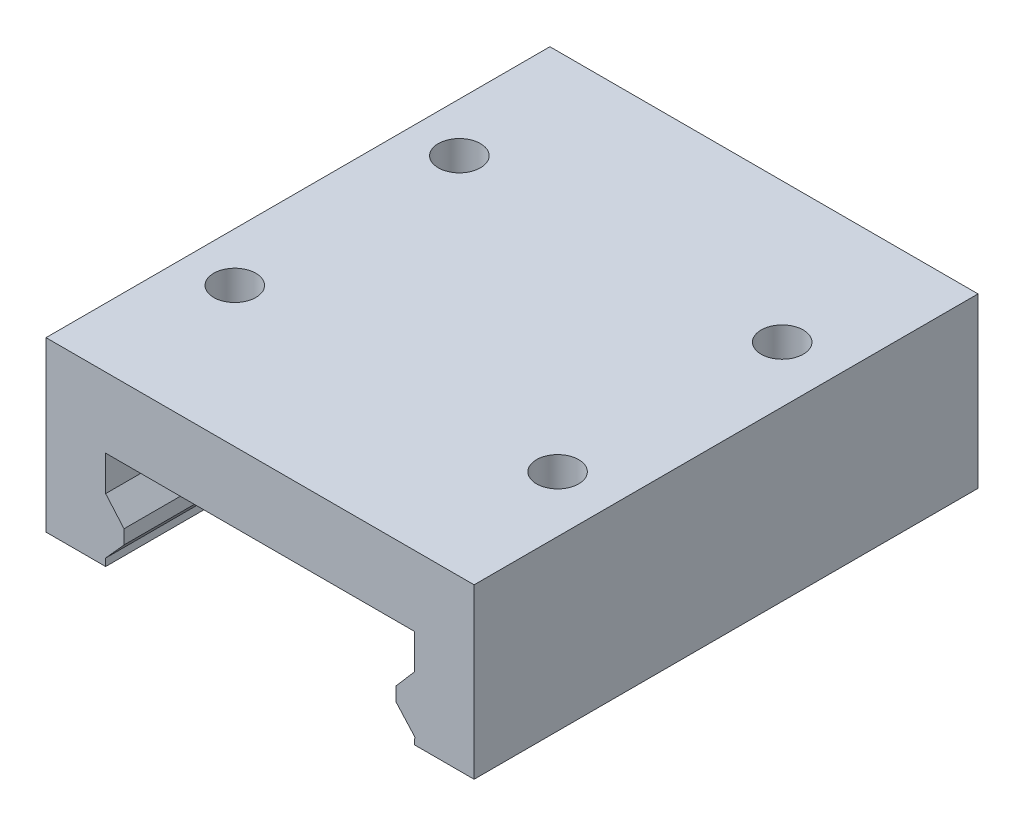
from build123d import *

# Parameters (mm, degrees)
EXTRUSION1_DEPTH = 71.8
ESQUISSE3_R      = 3
PERCAGE_DEPTH    = 6


with BuildPart() as part:
    # Esquisse1 → Extrusion1 (new body)
    with BuildSketch(Plane.XY):
        Polygon((-30.5, 3), (-22, 3), (-22.053966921, 3.998542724), (-19.382303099, 6.975489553), (-19.382303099, 8.975489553), (-22, 11.999999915), (-22, 16.999999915), (-21, 17), (21, 17), (22, 16.999999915), (22, 11.999999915), (19.382303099, 8.975489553), (19.382303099, 6.975489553), (22.053966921, 3.998542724), (22, 3), (30.5, 3), (30.5, 27), (-30.5, 27), align=None)
    extrude(amount=EXTRUSION1_DEPTH)

    # Esquisse3 → Percage (cut)
    with BuildSketch(Plane(origin=(0, 27, 0), x_dir=(-1, 0, 0), z_dir=(0, 1, 0))):
        with Locations((23.5, 19.9)):
            Circle(ESQUISSE3_R)
        with Locations((-22.5, 19.9)):
            Circle(ESQUISSE3_R)
        with Locations((-22.5, 51.9)):
            Circle(ESQUISSE3_R)
        with Locations((23.5, 51.9)):
            Circle(ESQUISSE3_R)
    extrude(amount=-PERCAGE_DEPTH, mode=Mode.SUBTRACT)


solid = part.part
